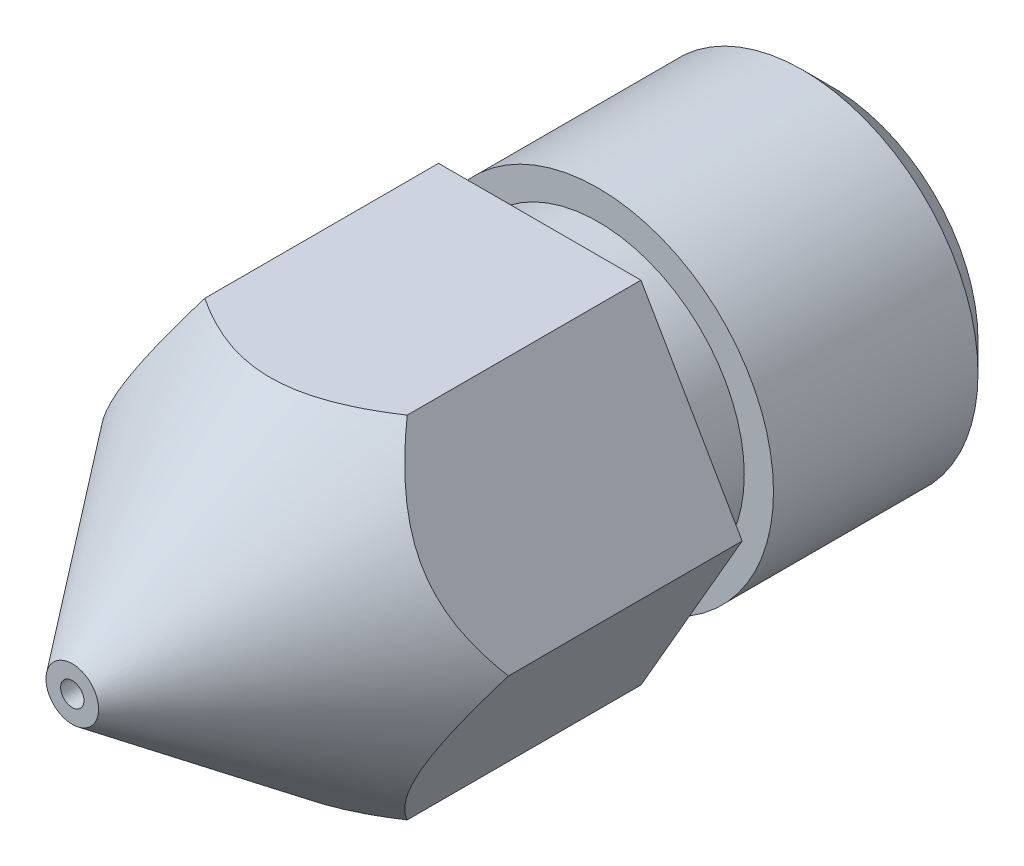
ISO-10303-21;
HEADER;
FILE_DESCRIPTION(('STEP AP214'),'2;1');
FILE_NAME('part.step','',(''),(''),'','','');
FILE_SCHEMA(('AUTOMOTIVE_DESIGN { 1 0 10303 214 1 1 1 1 }'));
ENDSEC;
DATA;
#1=APPLICATION_CONTEXT('core data for automotive mechanical design processes');
#2=APPLICATION_PROTOCOL_DEFINITION('international standard','automotive_design',2000,#1);
#3=PRODUCT_CONTEXT('',#1,'mechanical');
#4=PRODUCT('Part','Part','',(#3));
#5=PRODUCT_RELATED_PRODUCT_CATEGORY('part','',(#4));
#6=PRODUCT_DEFINITION_FORMATION('','',#4);
#7=PRODUCT_DEFINITION_CONTEXT('part definition',#1,'design');
#8=PRODUCT_DEFINITION('design','',#6,#7);
#9=PRODUCT_DEFINITION_SHAPE('','',#8);
#10=(LENGTH_UNIT() NAMED_UNIT(*) SI_UNIT(.MILLI.,.METRE.));
#11=(NAMED_UNIT(*) PLANE_ANGLE_UNIT() SI_UNIT($,.RADIAN.));
#12=(NAMED_UNIT(*) SI_UNIT($,.STERADIAN.) SOLID_ANGLE_UNIT());
#13=UNCERTAINTY_MEASURE_WITH_UNIT(LENGTH_MEASURE(1.E-05),#10,'distance_accuracy_value','');
#14=(GEOMETRIC_REPRESENTATION_CONTEXT(3) GLOBAL_UNCERTAINTY_ASSIGNED_CONTEXT((#13)) GLOBAL_UNIT_ASSIGNED_CONTEXT((#10,
#11,#12)) REPRESENTATION_CONTEXT('',''));
#15=CARTESIAN_POINT('',(0.,0.,0.));
#16=DIRECTION('',(0.,0.,1.));
#17=DIRECTION('',(1.,0.,0.));
#18=AXIS2_PLACEMENT_3D('',#15,#16,#17);
#19=CARTESIAN_POINT('',(0.,0.,0.));
#20=DIRECTION('',(0.,0.,1.));
#21=DIRECTION('',(1.,0.,0.));
#22=AXIS2_PLACEMENT_3D('',#19,#20,#21);
#23=CYLINDRICAL_SURFACE('',#22,2.5);
#24=CARTESIAN_POINT('',(0.,0.,0.));
#25=DIRECTION('',(0.,0.,1.));
#26=DIRECTION('',(1.,0.,0.));
#27=AXIS2_PLACEMENT_3D('',#24,#25,#26);
#28=CIRCLE('',#27,2.5);
#29=CARTESIAN_POINT('',(2.49999999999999,0.,0.));
#30=VERTEX_POINT('',#29);
#31=EDGE_CURVE('E22',#30,#30,#28,.F.);
#32=ORIENTED_EDGE('',*,*,#31,.T.);
#33=EDGE_LOOP('',(#32));
#34=FACE_BOUND('',#33,.T.);
#35=CARTESIAN_POINT('',(0.,0.,-1.));
#36=DIRECTION('',(0.,0.,1.));
#37=DIRECTION('',(1.,0.,0.));
#38=AXIS2_PLACEMENT_3D('',#35,#36,#37);
#39=CIRCLE('',#38,2.5);
#40=CARTESIAN_POINT('',(2.49999999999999,0.,-1.));
#41=VERTEX_POINT('',#40);
#42=EDGE_CURVE('E107',#41,#41,#39,.T.);
#43=ORIENTED_EDGE('',*,*,#42,.T.);
#44=EDGE_LOOP('',(#43));
#45=FACE_BOUND('',#44,.T.);
#46=ADVANCED_FACE('F19',(#34,#45),#23,.T.);
#47=CARTESIAN_POINT('',(0.,0.,0.));
#48=DIRECTION('',(0.,0.,1.));
#49=DIRECTION('',(1.,0.,0.));
#50=AXIS2_PLACEMENT_3D('',#47,#48,#49);
#51=PLANE('',#50);
#52=ORIENTED_EDGE('',*,*,#31,.F.);
#53=EDGE_LOOP('',(#52));
#54=FACE_BOUND('',#53,.T.);
#55=DIRECTION('',(-1.,0.,0.));
#56=VECTOR('',#55,1.);
#57=CARTESIAN_POINT('',(1.73205080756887,3.00000000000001,0.));
#58=LINE('',#57,#56);
#59=CARTESIAN_POINT('',(1.73205080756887,3.00000000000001,0.));
#60=VERTEX_POINT('',#59);
#61=CARTESIAN_POINT('',(-1.73205080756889,2.99999999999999,0.));
#62=VERTEX_POINT('',#61);
#63=EDGE_CURVE('E70',#60,#62,#58,.T.);
#64=ORIENTED_EDGE('',*,*,#63,.F.);
#65=DIRECTION('',(-0.500000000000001,0.866025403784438,0.));
#66=VECTOR('',#65,1.);
#67=CARTESIAN_POINT('',(3.46410161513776,0.,0.));
#68=LINE('',#67,#66);
#69=CARTESIAN_POINT('',(3.46410161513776,0.,0.));
#70=VERTEX_POINT('',#69);
#71=EDGE_CURVE('E100',#70,#60,#68,.T.);
#72=ORIENTED_EDGE('',*,*,#71,.F.);
#73=DIRECTION('',(0.499999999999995,0.866025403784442,0.));
#74=VECTOR('',#73,1.);
#75=CARTESIAN_POINT('',(1.73205080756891,-2.99999999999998,0.));
#76=LINE('',#75,#74);
#77=CARTESIAN_POINT('',(1.73205080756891,-2.99999999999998,0.));
#78=VERTEX_POINT('',#77);
#79=EDGE_CURVE('E105',#78,#70,#76,.T.);
#80=ORIENTED_EDGE('',*,*,#79,.F.);
#81=DIRECTION('',(1.,0.,0.));
#82=VECTOR('',#81,1.);
#83=CARTESIAN_POINT('',(-1.73205080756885,-3.00000000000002,0.));
#84=LINE('',#83,#82);
#85=CARTESIAN_POINT('',(-1.73205080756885,-3.00000000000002,0.));
#86=VERTEX_POINT('',#85);
#87=EDGE_CURVE('E111',#86,#78,#84,.T.);
#88=ORIENTED_EDGE('',*,*,#87,.F.);
#89=DIRECTION('',(0.500000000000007,-0.866025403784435,0.));
#90=VECTOR('',#89,1.);
#91=CARTESIAN_POINT('',(-3.46410161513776,0.,0.));
#92=LINE('',#91,#90);
#93=CARTESIAN_POINT('',(-3.46410161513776,0.,0.));
#94=VERTEX_POINT('',#93);
#95=EDGE_CURVE('E88',#94,#86,#92,.T.);
#96=ORIENTED_EDGE('',*,*,#95,.F.);
#97=DIRECTION('',(-0.499999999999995,-0.866025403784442,0.));
#98=VECTOR('',#97,1.);
#99=CARTESIAN_POINT('',(-1.73205080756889,2.99999999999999,0.));
#100=LINE('',#99,#98);
#101=EDGE_CURVE('E82',#62,#94,#100,.T.);
#102=ORIENTED_EDGE('',*,*,#101,.F.);
#103=EDGE_LOOP('',(#64,#72,#80,#88,#96,#102));
#104=FACE_BOUND('',#103,.T.);
#105=ADVANCED_FACE('F86',(#54,#104),#51,.F.);
#106=CARTESIAN_POINT('',(-3.46410161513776,0.,8.));
#107=DIRECTION('',(-0.866025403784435,-0.500000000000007,0.));
#108=DIRECTION('',(0.500000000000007,-0.866025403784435,0.));
#109=AXIS2_PLACEMENT_3D('',#106,#107,#108);
#110=PLANE('',#109);
#111=ORIENTED_EDGE('',*,*,#95,.T.);
#112=DIRECTION('',(0.,0.,1.));
#113=VECTOR('',#112,1.);
#114=CARTESIAN_POINT('',(-1.73205080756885,-3.00000000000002,8.));
#115=LINE('',#114,#113);
#116=CARTESIAN_POINT('',(-1.73205082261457,-2.99999997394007,4.00000001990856));
#117=VERTEX_POINT('',#116);
#118=EDGE_CURVE('E113',#117,#86,#115,.F.);
#119=ORIENTED_EDGE('',*,*,#118,.F.);
#120=CARTESIAN_POINT('',(-3.46410161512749,-1.78090844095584E-11,3.99999999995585));
#121=CARTESIAN_POINT('',(-3.44069021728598,-0.0405497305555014,4.0310628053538));
#122=CARTESIAN_POINT('',(-3.41706085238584,-0.0814769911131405,4.06148013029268));
#123=CARTESIAN_POINT('',(-3.36934820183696,-0.16411772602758,4.12079172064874));
#124=CARTESIAN_POINT('',(-3.34526518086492,-0.205830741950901,4.14968683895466));
#125=CARTESIAN_POINT('',(-3.29644056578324,-0.290397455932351,4.20594219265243));
#126=CARTESIAN_POINT('',(-3.27169567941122,-0.333256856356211,4.23329106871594));
#127=CARTESIAN_POINT('',(-3.22165527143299,-0.419929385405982,4.28600265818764));
#128=CARTESIAN_POINT('',(-3.19635926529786,-0.463743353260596,4.31136352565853));
#129=CARTESIAN_POINT('',(-3.11910484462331,-0.597551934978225,4.3845024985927));
#130=CARTESIAN_POINT('',(-3.06628459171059,-0.689039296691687,4.42874210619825));
#131=CARTESIAN_POINT('',(-2.95848675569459,-0.875750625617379,4.50488649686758));
#132=CARTESIAN_POINT('',(-2.9035124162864,-0.970968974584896,4.53680909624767));
#133=CARTESIAN_POINT('',(-2.81448457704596,-1.1251697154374,4.57560860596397));
#134=CARTESIAN_POINT('',(-2.78095977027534,-1.18323638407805,4.58739343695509));
#135=CARTESIAN_POINT('',(-2.71351247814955,-1.30005852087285,4.60510403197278));
#136=CARTESIAN_POINT('',(-2.67958993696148,-1.35881408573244,4.61102896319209));
#137=CARTESIAN_POINT('',(-2.61188290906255,-1.47608609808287,4.61672020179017));
#138=CARTESIAN_POINT('',(-2.57809943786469,-1.5346007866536,4.61653462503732));
#139=CARTESIAN_POINT('',(-2.51067843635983,-1.6513773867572,4.61013433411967));
#140=CARTESIAN_POINT('',(-2.47704090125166,-1.70963930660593,4.6039198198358));
#141=CARTESIAN_POINT('',(-2.41030893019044,-1.82522247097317,4.58577671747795));
#142=CARTESIAN_POINT('',(-2.37721275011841,-1.88254673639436,4.57387352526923));
#143=CARTESIAN_POINT('',(-2.31159334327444,-1.99620288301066,4.54483585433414));
#144=CARTESIAN_POINT('',(-2.27907037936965,-2.05253430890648,4.52769903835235));
#145=CARTESIAN_POINT('',(-2.18215411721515,-2.22039819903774,4.46905909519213));
#146=CARTESIAN_POINT('',(-2.11882576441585,-2.33008612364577,4.42045072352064));
#147=CARTESIAN_POINT('',(-1.99999917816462,-2.53589980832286,4.313482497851));
#148=CARTESIAN_POINT('',(-1.94426869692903,-2.63242783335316,4.25611473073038));
#149=CARTESIAN_POINT('',(-1.86291673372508,-2.77333356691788,4.16391653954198));
#150=CARTESIAN_POINT('',(-1.83634125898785,-2.81936363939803,4.13238684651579));
#151=CARTESIAN_POINT('',(-1.78377384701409,-2.91041306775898,4.06749851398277));
#152=CARTESIAN_POINT('',(-1.75778159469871,-2.95543296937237,4.03414089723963));
#153=CARTESIAN_POINT('',(-1.73205083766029,-2.99999994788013,4.0000000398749));
#154=B_SPLINE_CURVE_WITH_KNOTS('',3,(#120,#121,#122,#123,#124,#125,#126,#127,#128,#129,#130,
#131,#132,#133,#134,#135,#136,#137,#138,#139,#140,#141,#142,#143,#144,#145,#146,#147,#148,#149,
#150,#151,#152,#153),.UNSPECIFIED.,.F.,.F.,(4,2,2,2,2,2,2,2,2,2,2,2,2,2,2,2,4),(0.,
0.168572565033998,0.337049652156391,0.506636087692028,0.676378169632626,1.01936499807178,
1.36185382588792,1.56586036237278,1.7698958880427,1.9723251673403,2.17474773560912,
2.37627495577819,2.57789230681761,2.98360296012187,3.3591882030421,3.54455388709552,
3.72981689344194),.UNSPECIFIED.);
#155=CARTESIAN_POINT('',(-3.46410161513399,0.,3.99999999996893));
#156=VERTEX_POINT('',#155);
#157=EDGE_CURVE('E90',#156,#117,#154,.T.);
#158=ORIENTED_EDGE('',*,*,#157,.F.);
#159=DIRECTION('',(0.,0.,1.));
#160=VECTOR('',#159,1.);
#161=CARTESIAN_POINT('',(-3.46410161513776,0.,8.));
#162=LINE('',#161,#160);
#163=EDGE_CURVE('E36',#94,#156,#162,.T.);
#164=ORIENTED_EDGE('',*,*,#163,.F.);
#165=EDGE_LOOP('',(#111,#119,#158,#164));
#166=FACE_BOUND('',#165,.T.);
#167=ADVANCED_FACE('F191',(#166),#110,.T.);
#168=CARTESIAN_POINT('',(-1.73205080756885,-3.00000000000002,8.));
#169=DIRECTION('',(0.,-1.,0.));
#170=DIRECTION('',(1.,0.,0.));
#171=AXIS2_PLACEMENT_3D('',#168,#169,#170);
#172=PLANE('',#171);
#173=ORIENTED_EDGE('',*,*,#87,.T.);
#174=DIRECTION('',(0.,0.,1.));
#175=VECTOR('',#174,1.);
#176=CARTESIAN_POINT('',(1.73205080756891,-2.99999999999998,8.));
#177=LINE('',#176,#175);
#178=CARTESIAN_POINT('',(1.73205077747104,-2.99999999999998,4.00000001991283));
#179=VERTEX_POINT('',#178);
#180=EDGE_CURVE('E108',#179,#78,#177,.F.);
#181=ORIENTED_EDGE('',*,*,#180,.F.);
#182=CARTESIAN_POINT('',(-1.73205080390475,-2.99999997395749,3.99999998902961));
#183=CARTESIAN_POINT('',(-1.68522801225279,-2.9999999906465,4.03106280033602));
#184=CARTESIAN_POINT('',(-1.63796928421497,-2.99999999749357,4.06148012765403));
#185=CARTESIAN_POINT('',(-1.54254398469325,-3.00000000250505,4.12079171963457));
#186=CARTESIAN_POINT('',(-1.4943779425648,-3.00000000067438,4.1496868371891));
#187=CARTESIAN_POINT('',(-1.39672871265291,-2.99999999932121,4.2059421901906));
#188=CARTESIAN_POINT('',(-1.34723894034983,-2.99999999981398,4.23329106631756));
#189=CARTESIAN_POINT('',(-1.24715812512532,-3.00000000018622,4.28600265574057));
#190=CARTESIAN_POINT('',(-1.19656611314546,-3.00000000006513,4.31136352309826));
#191=CARTESIAN_POINT('',(-1.04205727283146,-2.99999999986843,4.38450249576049));
#192=CARTESIAN_POINT('',(-0.936416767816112,-2.99999999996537,4.42874210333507));
#193=CARTESIAN_POINT('',(-0.720821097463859,-3.00000000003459,4.50488649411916));
#194=CARTESIAN_POINT('',(-0.610872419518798,-3.00000000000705,4.53680909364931));
#195=CARTESIAN_POINT('',(-0.432816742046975,-2.99999999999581,4.57560860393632));
#196=CARTESIAN_POINT('',(-0.365767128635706,-2.99999999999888,4.58739343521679));
#197=CARTESIAN_POINT('',(-0.230872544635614,-3.00000000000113,4.60510403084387));
#198=CARTESIAN_POINT('',(-0.16302746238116,-3.0000000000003,4.61102896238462));
#199=CARTESIAN_POINT('',(-0.0276134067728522,-2.9999999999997,4.61672020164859));
#200=CARTESIAN_POINT('',(0.0399535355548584,-2.99999999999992,4.61653462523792));
#201=CARTESIAN_POINT('',(0.174795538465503,-3.00000000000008,4.61013433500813));
#202=CARTESIAN_POINT('',(0.242070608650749,-3.00000000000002,4.60391982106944));
#203=CARTESIAN_POINT('',(0.375534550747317,-2.99999999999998,4.58577671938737));
#204=CARTESIAN_POINT('',(0.441726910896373,-2.99999999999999,4.57387352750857));
#205=CARTESIAN_POINT('',(0.572965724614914,-3.,4.54483585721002));
#206=CARTESIAN_POINT('',(0.638011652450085,-3.,4.52769904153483));
#207=CARTESIAN_POINT('',(0.831844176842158,-2.99999999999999,4.4690590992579));
#208=CARTESIAN_POINT('',(0.958500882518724,-2.99999999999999,4.42045072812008));
#209=CARTESIAN_POINT('',(1.19615405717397,-2.99999999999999,4.31348250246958));
#210=CARTESIAN_POINT('',(1.30761502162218,-2.99999999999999,4.25611473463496));
#211=CARTESIAN_POINT('',(1.47031895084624,-2.99999999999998,4.16391654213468));
#212=CARTESIAN_POINT('',(1.52346990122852,-2.99999999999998,4.13238684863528));
#213=CARTESIAN_POINT('',(1.62860472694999,-2.99999999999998,4.06749851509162));
#214=CARTESIAN_POINT('',(1.68058923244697,-2.99999999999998,4.03414089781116));
#215=CARTESIAN_POINT('',(1.73205074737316,-2.99999999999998,4.00000003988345));
#216=B_SPLINE_CURVE_WITH_KNOTS('',3,(#182,#183,#184,#185,#186,#187,#188,#189,#190,#191,#192,
#193,#194,#195,#196,#197,#198,#199,#200,#201,#202,#203,#204,#205,#206,#207,#208,#209,#210,#211,
#212,#213,#214,#215),.UNSPECIFIED.,.F.,.F.,(4,2,2,2,2,2,2,2,2,2,2,2,2,2,2,2,4),(0.,
0.168572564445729,0.337049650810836,0.50663608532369,0.676378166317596,1.01936499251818,
1.36185381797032,1.56586035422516,1.76989587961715,1.97232515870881,2.17474772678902,
2.37627494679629,2.57789229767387,2.98360295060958,3.35918819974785,3.54455388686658,
3.72981689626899),.UNSPECIFIED.);
#217=EDGE_CURVE('E176',#117,#179,#216,.T.);
#218=ORIENTED_EDGE('',*,*,#217,.F.);
#219=ORIENTED_EDGE('',*,*,#118,.T.);
#220=EDGE_LOOP('',(#173,#181,#218,#219));
#221=FACE_BOUND('',#220,.T.);
#222=ADVANCED_FACE('F186',(#221),#172,.T.);
#223=CARTESIAN_POINT('',(1.73205080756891,-2.99999999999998,8.));
#224=DIRECTION('',(0.866025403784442,-0.499999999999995,0.));
#225=DIRECTION('',(0.499999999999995,0.866025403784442,0.));
#226=AXIS2_PLACEMENT_3D('',#223,#224,#225);
#227=PLANE('',#226);
#228=ORIENTED_EDGE('',*,*,#79,.T.);
#229=DIRECTION('',(0.,0.,1.));
#230=VECTOR('',#229,1.);
#231=CARTESIAN_POINT('',(3.46410161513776,0.,8.));
#232=LINE('',#231,#230);
#233=CARTESIAN_POINT('',(3.46410161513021,0.,3.99999999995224));
#234=VERTEX_POINT('',#233);
#235=EDGE_CURVE('E102',#234,#70,#232,.F.);
#236=ORIENTED_EDGE('',*,*,#235,.F.);
#237=CARTESIAN_POINT('',(1.73205078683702,-2.9999999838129,3.99999998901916));
#238=CARTESIAN_POINT('',(1.75546219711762,-2.95945026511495,4.03106280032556));
#239=CARTESIAN_POINT('',(1.77909156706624,-2.91852300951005,4.0614801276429));
#240=CARTESIAN_POINT('',(1.82680422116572,-2.83588227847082,4.12079171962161));
#241=CARTESIAN_POINT('',(1.85088724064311,-2.79416926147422,4.14968683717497));
#242=CARTESIAN_POINT('',(1.89971185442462,-2.70960254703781,4.2059421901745));
#243=CARTESIAN_POINT('',(1.92445674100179,-2.66674314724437,4.23329106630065));
#244=CARTESIAN_POINT('',(1.97449714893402,-2.58007061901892,4.28600265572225));
#245=CARTESIAN_POINT('',(1.99979315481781,-2.5362566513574,4.31136352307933));
#246=CARTESIAN_POINT('',(2.07704757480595,-2.40244807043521,4.38450249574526));
#247=CARTESIAN_POINT('',(2.12986782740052,-2.31096070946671,4.42874210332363));
#248=CARTESIAN_POINT('',(2.23766566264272,-2.12424938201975,4.50488649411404));
#249=CARTESIAN_POINT('',(2.2926400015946,-2.0290310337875,4.53680909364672));
#250=CARTESIAN_POINT('',(2.38166784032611,-1.87483029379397,4.57560860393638));
#251=CARTESIAN_POINT('',(2.41519264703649,-1.81676362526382,4.58739343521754));
#252=CARTESIAN_POINT('',(2.48263993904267,-1.69994148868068,4.60510403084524));
#253=CARTESIAN_POINT('',(2.51656248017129,-1.64118592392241,4.61102896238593));
#254=CARTESIAN_POINT('',(2.58426950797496,-1.52391391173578,4.61672020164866));
#255=CARTESIAN_POINT('',(2.61805297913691,-1.46539922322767,4.61653462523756));
#256=CARTESIAN_POINT('',(2.68547398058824,-1.34862262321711,4.61013433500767));
#257=CARTESIAN_POINT('',(2.71911151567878,-1.2903607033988,4.60391982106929));
#258=CARTESIAN_POINT('',(2.78584348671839,-1.17477753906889,4.58577671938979));
#259=CARTESIAN_POINT('',(2.81893966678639,-1.11745327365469,4.57387352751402));
#260=CARTESIAN_POINT('',(2.88455907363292,-1.00379712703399,4.54483585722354));
#261=CARTESIAN_POINT('',(2.9170820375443,-0.947465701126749,4.52769904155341));
#262=CARTESIAN_POINT('',(3.01399829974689,-0.779601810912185,4.46905909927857));
#263=CARTESIAN_POINT('',(3.07732665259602,-0.669913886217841,4.42045072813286));
#264=CARTESIAN_POINT('',(3.19615324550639,-0.464100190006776,4.31348249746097));
#265=CARTESIAN_POINT('',(3.25188373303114,-0.367572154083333,4.25611472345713));
#266=CARTESIAN_POINT('',(3.33323570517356,-0.226666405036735,4.16391652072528));
#267=CARTESIAN_POINT('',(3.35981118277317,-0.180636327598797,4.13238682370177));
#268=CARTESIAN_POINT('',(3.41237860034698,-0.0895868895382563,4.06749848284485));
#269=CARTESIAN_POINT('',(3.43837085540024,-0.0445669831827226,4.03414086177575));
#270=CARTESIAN_POINT('',(3.46410161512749,-1.77906543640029E-11,3.99999999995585));
#271=B_SPLINE_CURVE_WITH_KNOTS('',3,(#237,#238,#239,#240,#241,#242,#243,#244,#245,#246,#247,
#248,#249,#250,#251,#252,#253,#254,#255,#256,#257,#258,#259,#260,#261,#262,#263,#264,#265,#266,
#267,#268,#269,#270),.UNSPECIFIED.,.F.,.F.,(4,2,2,2,2,2,2,2,2,2,2,2,2,2,2,2,4),(0.,
0.168572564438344,0.337049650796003,0.50663608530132,0.676378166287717,1.01936499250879,
1.36185381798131,1.56586035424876,1.76989587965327,1.97232515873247,2.17474772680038,
2.37627494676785,2.57789229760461,2.98360295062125,3.35918823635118,3.54455394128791,
3.72981696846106),.UNSPECIFIED.);
#272=EDGE_CURVE('E170',#179,#234,#271,.T.);
#273=ORIENTED_EDGE('',*,*,#272,.F.);
#274=ORIENTED_EDGE('',*,*,#180,.T.);
#275=EDGE_LOOP('',(#228,#236,#273,#274));
#276=FACE_BOUND('',#275,.T.);
#277=ADVANCED_FACE('F183',(#276),#227,.T.);
#278=CARTESIAN_POINT('',(2.99999999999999,0.,-1.));
#279=DIRECTION('',(0.,0.,-1.));
#280=DIRECTION('',(-1.,0.,0.));
#281=AXIS2_PLACEMENT_3D('',#278,#279,#280);
#282=PLANE('',#281);
#283=CARTESIAN_POINT('',(0.,0.,-1.));
#284=DIRECTION('',(0.,0.,1.));
#285=DIRECTION('',(1.,0.,0.));
#286=AXIS2_PLACEMENT_3D('',#283,#284,#285);
#287=CIRCLE('',#286,2.99999999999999);
#288=CARTESIAN_POINT('',(2.99999999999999,0.,-1.));
#289=VERTEX_POINT('',#288);
#290=EDGE_CURVE('E167',#289,#289,#287,.F.);
#291=ORIENTED_EDGE('',*,*,#290,.F.);
#292=EDGE_LOOP('',(#291));
#293=FACE_BOUND('',#292,.T.);
#294=ORIENTED_EDGE('',*,*,#42,.F.);
#295=EDGE_LOOP('',(#294));
#296=FACE_BOUND('',#295,.T.);
#297=ADVANCED_FACE('F158',(#293,#296),#282,.F.);
#298=CARTESIAN_POINT('',(3.46410161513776,0.,8.));
#299=DIRECTION('',(0.866025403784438,0.500000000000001,0.));
#300=DIRECTION('',(-0.500000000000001,0.866025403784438,0.));
#301=AXIS2_PLACEMENT_3D('',#298,#299,#300);
#302=PLANE('',#301);
#303=ORIENTED_EDGE('',*,*,#71,.T.);
#304=DIRECTION('',(0.,0.,1.));
#305=VECTOR('',#304,1.);
#306=CARTESIAN_POINT('',(1.73205080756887,3.00000000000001,8.));
#307=LINE('',#306,#305);
#308=CARTESIAN_POINT('',(1.73205082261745,2.9999999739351,4.00000001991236));
#309=VERTEX_POINT('',#308);
#310=EDGE_CURVE('E76',#309,#60,#307,.F.);
#311=ORIENTED_EDGE('',*,*,#310,.F.);
#312=CARTESIAN_POINT('',(3.46410161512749,1.77913089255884E-11,3.99999999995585));
#313=CARTESIAN_POINT('',(3.44069021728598,0.040549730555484,4.03106280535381));
#314=CARTESIAN_POINT('',(3.41706085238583,0.0814769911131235,4.06148013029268));
#315=CARTESIAN_POINT('',(3.36934820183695,0.164117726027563,4.12079172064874));
#316=CARTESIAN_POINT('',(3.34526518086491,0.205830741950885,4.14968683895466));
#317=CARTESIAN_POINT('',(3.29644056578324,0.290397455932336,4.20594219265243));
#318=CARTESIAN_POINT('',(3.27169567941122,0.333256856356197,4.23329106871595));
#319=CARTESIAN_POINT('',(3.22165527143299,0.419929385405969,4.28600265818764));
#320=CARTESIAN_POINT('',(3.19635926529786,0.463743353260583,4.31136352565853));
#321=CARTESIAN_POINT('',(3.1191048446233,0.597551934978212,4.3845024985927));
#322=CARTESIAN_POINT('',(3.06628459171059,0.689039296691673,4.42874210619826));
#323=CARTESIAN_POINT('',(2.95848675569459,0.875750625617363,4.50488649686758));
#324=CARTESIAN_POINT('',(2.9035124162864,0.970968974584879,4.53680909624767));
#325=CARTESIAN_POINT('',(2.81448457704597,1.12516971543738,4.57560860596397));
#326=CARTESIAN_POINT('',(2.78095977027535,1.18323638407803,4.58739343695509));
#327=CARTESIAN_POINT('',(2.71351247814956,1.30005852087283,4.60510403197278));
#328=CARTESIAN_POINT('',(2.67958993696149,1.35881408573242,4.61102896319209));
#329=CARTESIAN_POINT('',(2.61188290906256,1.47608609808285,4.61672020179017));
#330=CARTESIAN_POINT('',(2.5780994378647,1.53460078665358,4.61653462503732));
#331=CARTESIAN_POINT('',(2.51067843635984,1.65137738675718,4.61013433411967));
#332=CARTESIAN_POINT('',(2.47704090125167,1.70963930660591,4.6039198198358));
#333=CARTESIAN_POINT('',(2.41030893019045,1.82522247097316,4.58577671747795));
#334=CARTESIAN_POINT('',(2.37721275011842,1.88254673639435,4.57387352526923));
#335=CARTESIAN_POINT('',(2.31159334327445,1.99620288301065,4.54483585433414));
#336=CARTESIAN_POINT('',(2.27907037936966,2.05253430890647,4.52769903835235));
#337=CARTESIAN_POINT('',(2.18215411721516,2.22039819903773,4.46905909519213));
#338=CARTESIAN_POINT('',(2.11882576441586,2.33008612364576,4.42045072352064));
#339=CARTESIAN_POINT('',(1.9999991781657,2.53589980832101,4.31348249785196));
#340=CARTESIAN_POINT('',(1.94426869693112,2.63242783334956,4.25611473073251));
#341=CARTESIAN_POINT('',(1.8629167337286,2.7733335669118,4.16391653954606));
#342=CARTESIAN_POINT('',(1.83634125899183,2.81936363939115,4.13238684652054));
#343=CARTESIAN_POINT('',(1.78377384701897,2.91041306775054,4.06749851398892));
#344=CARTESIAN_POINT('',(1.75778159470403,2.95543296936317,4.03414089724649));
#345=CARTESIAN_POINT('',(1.73205083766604,2.99999994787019,4.00000003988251));
#346=B_SPLINE_CURVE_WITH_KNOTS('',3,(#312,#313,#314,#315,#316,#317,#318,#319,#320,#321,#322,
#323,#324,#325,#326,#327,#328,#329,#330,#331,#332,#333,#334,#335,#336,#337,#338,#339,#340,#341,
#342,#343,#344,#345),.UNSPECIFIED.,.F.,.F.,(4,2,2,2,2,2,2,2,2,2,2,2,2,2,2,2,4),(0.,
0.168572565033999,0.337049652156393,0.506636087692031,0.67637816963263,1.01936499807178,
1.36185382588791,1.56586036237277,1.76989588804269,1.97232516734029,2.17474773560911,
2.37627495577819,2.57789230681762,2.98360296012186,3.35918820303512,3.54455388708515,
3.72981689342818),.UNSPECIFIED.);
#347=EDGE_CURVE('E161',#234,#309,#346,.T.);
#348=ORIENTED_EDGE('',*,*,#347,.F.);
#349=ORIENTED_EDGE('',*,*,#235,.T.);
#350=EDGE_LOOP('',(#303,#311,#348,#349));
#351=FACE_BOUND('',#350,.T.);
#352=ADVANCED_FACE('F154',(#351),#302,.T.);
#353=CARTESIAN_POINT('',(1.73205080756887,3.00000000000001,8.));
#354=DIRECTION('',(0.,1.,0.));
#355=DIRECTION('',(-1.,0.,0.));
#356=AXIS2_PLACEMENT_3D('',#353,#354,#355);
#357=PLANE('',#356);
#358=ORIENTED_EDGE('',*,*,#63,.T.);
#359=DIRECTION('',(0.,0.,1.));
#360=VECTOR('',#359,1.);
#361=CARTESIAN_POINT('',(-1.73205080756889,2.99999999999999,8.));
#362=LINE('',#361,#360);
#363=CARTESIAN_POINT('',(-1.73205077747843,2.99999999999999,4.00000001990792));
#364=VERTEX_POINT('',#363);
#365=EDGE_CURVE('E74',#364,#62,#362,.F.);
#366=ORIENTED_EDGE('',*,*,#365,.F.);
#367=CARTESIAN_POINT('',(1.73205080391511,2.99999997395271,3.99999998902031));
#368=CARTESIAN_POINT('',(1.68522801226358,2.99999999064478,4.03106280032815));
#369=CARTESIAN_POINT('',(1.63796928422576,2.9999999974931,4.06148012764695));
#370=CARTESIAN_POINT('',(1.54254398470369,3.0000000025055,4.12079171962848));
#371=CARTESIAN_POINT('',(1.49437794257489,3.0000000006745,4.14968683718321));
#372=CARTESIAN_POINT('',(1.39672871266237,2.99999999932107,4.20594219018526));
#373=CARTESIAN_POINT('',(1.34723894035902,2.99999999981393,4.23329106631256));
#374=CARTESIAN_POINT('',(1.24715812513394,3.00000000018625,4.28600265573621));
#375=CARTESIAN_POINT('',(1.19656611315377,3.00000000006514,4.31136352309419));
#376=CARTESIAN_POINT('',(1.04205727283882,2.9999999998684,4.38450249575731));
#377=CARTESIAN_POINT('',(0.936416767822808,2.99999999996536,4.42874210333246));
#378=CARTESIAN_POINT('',(0.720821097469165,3.0000000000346,4.50488649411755));
#379=CARTESIAN_POINT('',(0.610872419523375,3.00000000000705,4.53680909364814));
#380=CARTESIAN_POINT('',(0.432816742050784,2.9999999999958,4.5756086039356));
#381=CARTESIAN_POINT('',(0.365767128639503,2.99999999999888,4.58739343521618));
#382=CARTESIAN_POINT('',(0.230872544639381,3.00000000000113,4.60510403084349));
#383=CARTESIAN_POINT('',(0.163027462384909,3.0000000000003,4.61102896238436));
#384=CARTESIAN_POINT('',(0.0276134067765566,2.9999999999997,4.61672020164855));
#385=CARTESIAN_POINT('',(-0.0399535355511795,2.99999999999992,4.61653462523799));
#386=CARTESIAN_POINT('',(-0.174795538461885,3.00000000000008,4.61013433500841));
#387=CARTESIAN_POINT('',(-0.242070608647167,3.00000000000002,4.60391982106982));
#388=CARTESIAN_POINT('',(-0.375534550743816,2.99999999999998,4.58577671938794));
#389=CARTESIAN_POINT('',(-0.441726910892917,2.99999999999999,4.57387352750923));
#390=CARTESIAN_POINT('',(-0.572965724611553,3.,4.54483585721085));
#391=CARTESIAN_POINT('',(-0.638011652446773,3.,4.52769904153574));
#392=CARTESIAN_POINT('',(-0.831844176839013,2.99999999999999,4.46905909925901));
#393=CARTESIAN_POINT('',(-0.958500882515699,3.,4.4204507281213));
#394=CARTESIAN_POINT('',(-1.19615405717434,3.,4.31348250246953));
#395=CARTESIAN_POINT('',(-1.30761502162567,3.,4.2561147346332));
#396=CARTESIAN_POINT('',(-1.47031895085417,3.,4.16391654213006));
#397=CARTESIAN_POINT('',(-1.52346990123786,3.,4.13238684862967));
#398=CARTESIAN_POINT('',(-1.62860472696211,2.99999999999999,4.06749851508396));
#399=CARTESIAN_POINT('',(-1.68058923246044,2.99999999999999,4.03414089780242));
#400=CARTESIAN_POINT('',(-1.73205074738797,2.99999999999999,4.00000003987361));
#401=B_SPLINE_CURVE_WITH_KNOTS('',3,(#367,#368,#369,#370,#371,#372,#373,#374,#375,#376,#377,
#378,#379,#380,#381,#382,#383,#384,#385,#386,#387,#388,#389,#390,#391,#392,#393,#394,#395,#396,
#397,#398,#399,#400),.UNSPECIFIED.,.F.,.F.,(4,2,2,2,2,2,2,2,2,2,2,2,2,2,2,2,4),(0.,
0.168572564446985,0.337049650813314,0.506636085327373,0.6763781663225,1.01936499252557,
1.36185381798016,1.56586035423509,1.76989587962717,1.9723251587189,2.17474772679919,
2.37627494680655,2.5778922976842,2.98360295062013,3.35918819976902,3.54455388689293,
3.72981689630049),.UNSPECIFIED.);
#402=EDGE_CURVE('E137',#309,#364,#401,.T.);
#403=ORIENTED_EDGE('',*,*,#402,.F.);
#404=ORIENTED_EDGE('',*,*,#310,.T.);
#405=EDGE_LOOP('',(#358,#366,#403,#404));
#406=FACE_BOUND('',#405,.T.);
#407=ADVANCED_FACE('F72',(#406),#357,.T.);
#408=CARTESIAN_POINT('',(-1.73205080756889,2.99999999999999,8.));
#409=DIRECTION('',(-0.866025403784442,0.499999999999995,0.));
#410=DIRECTION('',(-0.499999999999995,-0.866025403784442,0.));
#411=AXIS2_PLACEMENT_3D('',#408,#409,#410);
#412=PLANE('',#411);
#413=ORIENTED_EDGE('',*,*,#101,.T.);
#414=ORIENTED_EDGE('',*,*,#163,.T.);
#415=CARTESIAN_POINT('',(-1.73205078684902,2.99999998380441,3.99999998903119));
#416=CARTESIAN_POINT('',(-1.75546219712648,2.95945026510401,4.03106280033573));
#417=CARTESIAN_POINT('',(-1.7790915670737,2.9185230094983,4.06148012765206));
#418=CARTESIAN_POINT('',(-1.82680422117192,2.83588227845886,4.12079171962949));
#419=CARTESIAN_POINT('',(-1.85088724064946,2.79416926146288,4.14968683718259));
#420=CARTESIAN_POINT('',(-1.89971185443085,2.70960254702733,4.20594219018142));
#421=CARTESIAN_POINT('',(-1.92445674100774,2.66674314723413,4.23329106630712));
#422=CARTESIAN_POINT('',(-1.97449714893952,2.58007061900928,4.28600265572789));
#423=CARTESIAN_POINT('',(-1.99979315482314,2.53625665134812,4.31136352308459));
#424=CARTESIAN_POINT('',(-2.0770475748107,2.40244807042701,4.38450249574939));
#425=CARTESIAN_POINT('',(-2.12986782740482,2.31096070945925,4.42874210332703));
#426=CARTESIAN_POINT('',(-2.23766566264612,2.12424938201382,4.50488649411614));
#427=CARTESIAN_POINT('',(-2.29264000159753,2.02903103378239,4.53680909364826));
#428=CARTESIAN_POINT('',(-2.38166784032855,1.87483029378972,4.57560860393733));
#429=CARTESIAN_POINT('',(-2.41519264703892,1.81676362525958,4.58739343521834));
#430=CARTESIAN_POINT('',(-2.48263993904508,1.69994148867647,4.60510403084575));
#431=CARTESIAN_POINT('',(-2.51656248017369,1.64118592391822,4.61102896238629));
#432=CARTESIAN_POINT('',(-2.58426950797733,1.52391391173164,4.61672020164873));
#433=CARTESIAN_POINT('',(-2.61805297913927,1.46539922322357,4.6165346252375));
#434=CARTESIAN_POINT('',(-2.68547398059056,1.34862262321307,4.61013433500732));
#435=CARTESIAN_POINT('',(-2.71911151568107,1.29036070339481,4.60391982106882));
#436=CARTESIAN_POINT('',(-2.78584348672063,1.17477753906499,4.58577671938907));
#437=CARTESIAN_POINT('',(-2.8189396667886,1.11745327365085,4.57387352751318));
#438=CARTESIAN_POINT('',(-2.88455907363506,1.00379712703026,4.54483585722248));
#439=CARTESIAN_POINT('',(-2.91708203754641,0.947465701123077,4.52769904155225));
#440=CARTESIAN_POINT('',(-3.01399829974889,0.779601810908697,4.46905909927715));
#441=CARTESIAN_POINT('',(-3.07732665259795,0.669913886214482,4.42045072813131));
#442=CARTESIAN_POINT('',(-3.1961532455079,0.464100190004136,4.31348249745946));
#443=CARTESIAN_POINT('',(-3.25188373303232,0.36757215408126,4.25611472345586));
#444=CARTESIAN_POINT('',(-3.33323570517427,0.226666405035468,4.16391652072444));
#445=CARTESIAN_POINT('',(-3.35981118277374,0.180636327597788,4.13238682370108));
#446=CARTESIAN_POINT('',(-3.41237860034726,0.089586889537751,4.06749848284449));
#447=CARTESIAN_POINT('',(-3.43837085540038,0.0445669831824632,4.03414086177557));
#448=CARTESIAN_POINT('',(-3.46410161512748,1.77726889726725E-11,3.99999999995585));
#449=B_SPLINE_CURVE_WITH_KNOTS('',3,(#415,#416,#417,#418,#419,#420,#421,#422,#423,#424,#425,
#426,#427,#428,#429,#430,#431,#432,#433,#434,#435,#436,#437,#438,#439,#440,#441,#442,#443,#444,
#445,#446,#447,#448),.UNSPECIFIED.,.F.,.F.,(4,2,2,2,2,2,2,2,2,2,2,2,2,2,2,2,4),(0.,
0.16857256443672,0.3370496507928,0.50663608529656,0.676378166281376,1.01936499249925,
1.36185381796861,1.56586035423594,1.76989587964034,1.97232515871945,2.17474772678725,
2.37627494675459,2.57789229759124,2.98360295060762,3.35918823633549,3.54455394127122,
3.72981696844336),.UNSPECIFIED.);
#450=EDGE_CURVE('E84',#364,#156,#449,.T.);
#451=ORIENTED_EDGE('',*,*,#450,.F.);
#452=ORIENTED_EDGE('',*,*,#365,.T.);
#453=EDGE_LOOP('',(#413,#414,#451,#452));
#454=FACE_BOUND('',#453,.T.);
#455=ADVANCED_FACE('F81',(#454),#412,.T.);
#456=CARTESIAN_POINT('',(0.,0.,-5.));
#457=DIRECTION('',(0.,0.,1.));
#458=DIRECTION('',(1.,0.,0.));
#459=AXIS2_PLACEMENT_3D('',#456,#457,#458);
#460=CYLINDRICAL_SURFACE('',#459,2.99999999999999);
#461=ORIENTED_EDGE('',*,*,#290,.T.);
#462=EDGE_LOOP('',(#461));
#463=FACE_BOUND('',#462,.T.);
#464=CARTESIAN_POINT('',(0.,0.,-4.50000000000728));
#465=DIRECTION('',(0.,0.,1.));
#466=DIRECTION('',(1.,0.,0.));
#467=AXIS2_PLACEMENT_3D('',#464,#465,#466);
#468=CIRCLE('',#467,2.9999999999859);
#469=CARTESIAN_POINT('',(2.9999999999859,0.,-4.50000000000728));
#470=VERTEX_POINT('',#469);
#471=EDGE_CURVE('E129',#470,#470,#468,.F.);
#472=ORIENTED_EDGE('',*,*,#471,.F.);
#473=EDGE_LOOP('',(#472));
#474=FACE_BOUND('',#473,.T.);
#475=ADVANCED_FACE('F150',(#463,#474),#460,.T.);
#476=CARTESIAN_POINT('',(0.,0.,3.97599999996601));
#477=DIRECTION('',(0.,0.,-1.));
#478=DIRECTION('',(-1.,0.,0.));
#479=AXIS2_PLACEMENT_3D('',#476,#477,#478);
#480=CONICAL_SURFACE('',#479,3.48218691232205,0.645771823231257);
#481=ORIENTED_EDGE('',*,*,#272,.T.);
#482=ORIENTED_EDGE('',*,*,#347,.T.);
#483=ORIENTED_EDGE('',*,*,#402,.T.);
#484=ORIENTED_EDGE('',*,*,#450,.T.);
#485=ORIENTED_EDGE('',*,*,#157,.T.);
#486=ORIENTED_EDGE('',*,*,#217,.T.);
#487=EDGE_LOOP('',(#481,#482,#483,#484,#485,#486));
#488=FACE_BOUND('',#487,.T.);
#489=CARTESIAN_POINT('',(0.,0.,8.0000000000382));
#490=DIRECTION('',(0.,0.,-1.));
#491=DIRECTION('',(-1.,0.,0.));
#492=AXIS2_PLACEMENT_3D('',#489,#490,#491);
#493=CIRCLE('',#492,0.449885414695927);
#494=CARTESIAN_POINT('',(-0.449885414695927,0.,8.0000000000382));
#495=VERTEX_POINT('',#494);
#496=EDGE_CURVE('E126',#495,#495,#493,.F.);
#497=ORIENTED_EDGE('',*,*,#496,.F.);
#498=EDGE_LOOP('',(#497));
#499=FACE_BOUND('',#498,.T.);
#500=ADVANCED_FACE('F144',(#488,#499),#480,.T.);
#501=CARTESIAN_POINT('',(0.,0.,-4.50000000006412));
#502=DIRECTION('',(0.,0.,1.));
#503=DIRECTION('',(1.,0.,0.));
#504=AXIS2_PLACEMENT_3D('',#501,#502,#503);
#505=CONICAL_SURFACE('',#504,2.99999999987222,0.785398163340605);
#506=ORIENTED_EDGE('',*,*,#471,.T.);
#507=EDGE_LOOP('',(#506));
#508=FACE_BOUND('',#507,.T.);
#509=CARTESIAN_POINT('',(0.,0.,-4.99999999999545));
#510=DIRECTION('',(0.,0.,1.));
#511=DIRECTION('',(1.,0.,0.));
#512=AXIS2_PLACEMENT_3D('',#509,#510,#511);
#513=CIRCLE('',#512,2.49999999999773);
#514=CARTESIAN_POINT('',(2.49999999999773,0.,-4.99999999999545));
#515=VERTEX_POINT('',#514);
#516=EDGE_CURVE('E123',#515,#515,#513,.F.);
#517=ORIENTED_EDGE('',*,*,#516,.F.);
#518=EDGE_LOOP('',(#517));
#519=FACE_BOUND('',#518,.T.);
#520=ADVANCED_FACE('F258',(#508,#519),#505,.T.);
#521=CARTESIAN_POINT('',(0.,0.,8.));
#522=DIRECTION('',(0.,0.,1.));
#523=DIRECTION('',(1.,0.,0.));
#524=AXIS2_PLACEMENT_3D('',#521,#522,#523);
#525=PLANE('',#524);
#526=ORIENTED_EDGE('',*,*,#496,.T.);
#527=EDGE_LOOP('',(#526));
#528=FACE_BOUND('',#527,.T.);
#529=CARTESIAN_POINT('',(0.,0.,8.));
#530=DIRECTION('',(0.,0.,1.));
#531=DIRECTION('',(1.,0.,0.));
#532=AXIS2_PLACEMENT_3D('',#529,#530,#531);
#533=CIRCLE('',#532,0.2);
#534=CARTESIAN_POINT('',(0.2,0.,8.));
#535=VERTEX_POINT('',#534);
#536=EDGE_CURVE('E120',#535,#535,#533,.F.);
#537=ORIENTED_EDGE('',*,*,#536,.T.);
#538=EDGE_LOOP('',(#537));
#539=FACE_BOUND('',#538,.T.);
#540=ADVANCED_FACE('F255',(#528,#539),#525,.T.);
#541=CARTESIAN_POINT('',(0.,0.,-5.));
#542=DIRECTION('',(0.,0.,-1.));
#543=DIRECTION('',(-1.,0.,0.));
#544=AXIS2_PLACEMENT_3D('',#541,#542,#543);
#545=PLANE('',#544);
#546=ORIENTED_EDGE('',*,*,#516,.T.);
#547=EDGE_LOOP('',(#546));
#548=FACE_BOUND('',#547,.T.);
#549=CARTESIAN_POINT('',(0.,0.,-4.99999999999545));
#550=DIRECTION('',(0.,0.,-1.));
#551=DIRECTION('',(-1.,0.,0.));
#552=AXIS2_PLACEMENT_3D('',#549,#550,#551);
#553=CIRCLE('',#552,1.50000000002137);
#554=CARTESIAN_POINT('',(-1.50000000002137,0.,-4.99999999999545));
#555=VERTEX_POINT('',#554);
#556=EDGE_CURVE('E116',#555,#555,#553,.F.);
#557=ORIENTED_EDGE('',*,*,#556,.T.);
#558=EDGE_LOOP('',(#557));
#559=FACE_BOUND('',#558,.T.);
#560=ADVANCED_FACE('F251',(#548,#559),#545,.T.);
#561=CARTESIAN_POINT('',(0.,0.,-5.));
#562=DIRECTION('',(0.,0.,1.));
#563=DIRECTION('',(1.,0.,0.));
#564=AXIS2_PLACEMENT_3D('',#561,#562,#563);
#565=CYLINDRICAL_SURFACE('',#564,0.2);
#566=ORIENTED_EDGE('',*,*,#536,.F.);
#567=EDGE_LOOP('',(#566));
#568=FACE_BOUND('',#567,.T.);
#569=CARTESIAN_POINT('',(0.,0.,7.20000000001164));
#570=DIRECTION('',(0.,0.,-1.));
#571=DIRECTION('',(-1.,0.,0.));
#572=AXIS2_PLACEMENT_3D('',#569,#570,#571);
#573=CIRCLE('',#572,0.199999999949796);
#574=CARTESIAN_POINT('',(0.,0.200000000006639,7.20000000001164));
#575=VERTEX_POINT('',#574);
#576=EDGE_CURVE('E119',#575,#575,#573,.T.);
#577=ORIENTED_EDGE('',*,*,#576,.T.);
#578=EDGE_LOOP('',(#577));
#579=FACE_BOUND('',#578,.T.);
#580=ADVANCED_FACE('F247',(#568,#579),#565,.F.);
#581=CARTESIAN_POINT('',(0.,0.,-4.99999999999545));
#582=DIRECTION('',(0.,0.,-1.));
#583=DIRECTION('',(-1.,0.,0.));
#584=AXIS2_PLACEMENT_3D('',#581,#582,#583);
#585=CONICAL_SURFACE('',#584,1.50000000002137,0.785398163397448);
#586=ORIENTED_EDGE('',*,*,#556,.F.);
#587=EDGE_LOOP('',(#586));
#588=FACE_BOUND('',#587,.T.);
#589=CARTESIAN_POINT('',(0.,0.,-4.49999999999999));
#590=DIRECTION('',(0.,0.,-1.));
#591=DIRECTION('',(-1.,0.,0.));
#592=AXIS2_PLACEMENT_3D('',#589,#590,#591);
#593=CIRCLE('',#592,0.999999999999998);
#594=CARTESIAN_POINT('',(-0.999999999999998,0.,-4.49999999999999));
#595=VERTEX_POINT('',#594);
#596=EDGE_CURVE('E28',#595,#595,#593,.F.);
#597=ORIENTED_EDGE('',*,*,#596,.T.);
#598=EDGE_LOOP('',(#597));
#599=FACE_BOUND('',#598,.T.);
#600=ADVANCED_FACE('F239',(#588,#599),#585,.F.);
#601=CARTESIAN_POINT('',(0.,0.,6.40000000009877));
#602=DIRECTION('',(0.,0.,-1.));
#603=DIRECTION('',(0.,1.,0.));
#604=AXIS2_PLACEMENT_3D('',#601,#602,#603);
#605=CONICAL_SURFACE('',#604,0.999999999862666,0.785398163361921);
#606=CARTESIAN_POINT('',(0.,0.,6.4));
#607=DIRECTION('',(0.,0.,-1.));
#608=DIRECTION('',(-1.,0.,0.));
#609=AXIS2_PLACEMENT_3D('',#606,#607,#608);
#610=CIRCLE('',#609,0.999999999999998);
#611=CARTESIAN_POINT('',(0.,0.999999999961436,6.4));
#612=VERTEX_POINT('',#611);
#613=EDGE_CURVE('E11',#612,#612,#610,.T.);
#614=CARTESIAN_POINT('',(0.,0.200000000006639,7.20000000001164));
#615=CARTESIAN_POINT('',(0.,0.208333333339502,7.19166666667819));
#616=CARTESIAN_POINT('',(0.,0.216666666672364,7.18333333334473));
#617=CARTESIAN_POINT('',(0.,0.233333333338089,7.16666666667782));
#618=CARTESIAN_POINT('',(0.,0.241666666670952,7.15833333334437));
#619=CARTESIAN_POINT('',(0.,0.258333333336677,7.14166666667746));
#620=CARTESIAN_POINT('',(0.,0.266666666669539,7.13333333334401));
#621=CARTESIAN_POINT('',(0.,0.283333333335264,7.1166666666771));
#622=CARTESIAN_POINT('',(0.,0.291666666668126,7.10833333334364));
#623=CARTESIAN_POINT('',(0.,0.308333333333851,7.09166666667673));
#624=CARTESIAN_POINT('',(0.,0.316666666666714,7.08333333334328));
#625=CARTESIAN_POINT('',(0.,0.333333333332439,7.06666666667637));
#626=CARTESIAN_POINT('',(0.,0.341666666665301,7.05833333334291));
#627=CARTESIAN_POINT('',(0.,0.358333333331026,7.041666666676));
#628=CARTESIAN_POINT('',(0.,0.366666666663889,7.03333333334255));
#629=CARTESIAN_POINT('',(0.,0.383333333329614,7.01666666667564));
#630=CARTESIAN_POINT('',(0.,0.391666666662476,7.00833333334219));
#631=CARTESIAN_POINT('',(0.,0.408333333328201,6.99166666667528));
#632=CARTESIAN_POINT('',(0.,0.416666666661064,6.98333333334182));
#633=CARTESIAN_POINT('',(0.,0.433333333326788,6.96666666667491));
#634=CARTESIAN_POINT('',(0.,0.441666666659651,6.95833333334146));
#635=CARTESIAN_POINT('',(0.,0.458333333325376,6.94166666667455));
#636=CARTESIAN_POINT('',(0.,0.466666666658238,6.9333333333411));
#637=CARTESIAN_POINT('',(0.,0.483333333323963,6.91666666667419));
#638=CARTESIAN_POINT('',(0.,0.491666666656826,6.90833333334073));
#639=CARTESIAN_POINT('',(0.,0.508333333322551,6.89166666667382));
#640=CARTESIAN_POINT('',(0.,0.516666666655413,6.88333333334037));
#641=CARTESIAN_POINT('',(0.,0.533333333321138,6.86666666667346));
#642=CARTESIAN_POINT('',(0.,0.541666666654,6.85833333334));
#643=CARTESIAN_POINT('',(0.,0.558333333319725,6.84166666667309));
#644=CARTESIAN_POINT('',(0.,0.566666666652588,6.83333333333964));
#645=CARTESIAN_POINT('',(0.,0.583333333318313,6.81666666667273));
#646=CARTESIAN_POINT('',(0.,0.591666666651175,6.80833333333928));
#647=CARTESIAN_POINT('',(0.,0.6083333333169,6.79166666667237));
#648=CARTESIAN_POINT('',(0.,0.616666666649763,6.78333333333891));
#649=CARTESIAN_POINT('',(0.,0.633333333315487,6.766666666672));
#650=CARTESIAN_POINT('',(0.,0.64166666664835,6.75833333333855));
#651=CARTESIAN_POINT('',(0.,0.658333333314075,6.74166666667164));
#652=CARTESIAN_POINT('',(0.,0.666666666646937,6.73333333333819));
#653=CARTESIAN_POINT('',(0.,0.683333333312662,6.71666666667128));
#654=CARTESIAN_POINT('',(0.,0.691666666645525,6.70833333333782));
#655=CARTESIAN_POINT('',(0.,0.708333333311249,6.69166666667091));
#656=CARTESIAN_POINT('',(0.,0.716666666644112,6.68333333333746));
#657=CARTESIAN_POINT('',(0.,0.733333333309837,6.66666666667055));
#658=CARTESIAN_POINT('',(0.,0.741666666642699,6.65833333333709));
#659=CARTESIAN_POINT('',(0.,0.758333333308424,6.64166666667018));
#660=CARTESIAN_POINT('',(0.,0.766666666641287,6.63333333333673));
#661=CARTESIAN_POINT('',(0.,0.783333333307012,6.61666666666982));
#662=CARTESIAN_POINT('',(0.,0.791666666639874,6.60833333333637));
#663=CARTESIAN_POINT('',(0.,0.808333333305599,6.59166666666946));
#664=CARTESIAN_POINT('',(0.,0.816666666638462,6.583333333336));
#665=CARTESIAN_POINT('',(0.,0.833333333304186,6.56666666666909));
#666=CARTESIAN_POINT('',(0.,0.841666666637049,6.55833333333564));
#667=CARTESIAN_POINT('',(0.,0.858333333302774,6.54166666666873));
#668=CARTESIAN_POINT('',(0.,0.866666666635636,6.53333333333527));
#669=CARTESIAN_POINT('',(0.,0.883333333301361,6.51666666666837));
#670=CARTESIAN_POINT('',(0.,0.891666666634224,6.50833333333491));
#671=CARTESIAN_POINT('',(0.,0.908333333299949,6.491666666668));
#672=CARTESIAN_POINT('',(0.,0.916666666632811,6.48333333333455));
#673=CARTESIAN_POINT('',(0.,0.933333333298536,6.46666666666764));
#674=CARTESIAN_POINT('',(0.,0.941666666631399,6.45833333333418));
#675=CARTESIAN_POINT('',(0.,0.958333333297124,6.44166666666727));
#676=CARTESIAN_POINT('',(0.,0.966666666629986,6.43333333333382));
#677=CARTESIAN_POINT('',(0.,0.983333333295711,6.41666666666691));
#678=CARTESIAN_POINT('',(0.,0.991666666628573,6.40833333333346));
#679=CARTESIAN_POINT('',(0.,0.999999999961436,6.4));
#680=B_SPLINE_CURVE_WITH_KNOTS('',3,(#614,#615,#616,#617,#618,#619,#620,#621,#622,#623,#624,
#625,#626,#627,#628,#629,#630,#631,#632,#633,#634,#635,#636,#637,#638,#639,#640,#641,#642,#643,
#644,#645,#646,#647,#648,#649,#650,#651,#652,#653,#654,#655,#656,#657,#658,#659,#660,#661,#662,
#663,#664,#665,#666,#667,#668,#669,#670,#671,#672,#673,#674,#675,#676,#677,#678,#679),
.UNSPECIFIED.,.F.,.F.,(4,2,2,2,2,2,2,2,2,2,2,2,2,2,2,2,2,2,2,2,2,2,2,2,2,2,2,2,2,2,2,2,4),(0.,
0.0353553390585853,0.0707106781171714,0.106066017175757,0.141421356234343,0.176776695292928,
0.212132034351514,0.2474873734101,0.282842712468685,0.318198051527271,0.353553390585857,
0.388908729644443,0.424264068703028,0.459619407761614,0.4949747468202,0.530330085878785,
0.565685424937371,0.601040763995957,0.636396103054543,0.671751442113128,0.707106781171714,
0.7424621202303,0.777817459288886,0.813172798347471,0.848528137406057,0.883883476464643,
0.919238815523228,0.954594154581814,0.9899494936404,1.02530483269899,1.06066017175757,
1.09601551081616,1.13137084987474),.UNSPECIFIED.);
#681=EDGE_CURVE('BSEAM233',#575,#612,#680,.T.);
#682=ORIENTED_EDGE('',*,*,#576,.F.);
#683=ORIENTED_EDGE('',*,*,#613,.T.);
#684=ORIENTED_EDGE('',*,*,#681,.T.);
#685=ORIENTED_EDGE('',*,*,#681,.F.);
#686=EDGE_LOOP('',(#682,#684,#683,#685));
#687=FACE_BOUND('',#686,.T.);
#688=ADVANCED_FACE('F233',(#687),#605,.F.);
#689=CARTESIAN_POINT('',(0.,0.,-5.));
#690=DIRECTION('',(0.,0.,-1.));
#691=DIRECTION('',(-1.,0.,0.));
#692=AXIS2_PLACEMENT_3D('',#689,#690,#691);
#693=CYLINDRICAL_SURFACE('',#692,0.999999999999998);
#694=ORIENTED_EDGE('',*,*,#596,.F.);
#695=EDGE_LOOP('',(#694));
#696=FACE_BOUND('',#695,.T.);
#697=ORIENTED_EDGE('',*,*,#613,.F.);
#698=EDGE_LOOP('',(#697));
#699=FACE_BOUND('',#698,.T.);
#700=ADVANCED_FACE('F231',(#696,#699),#693,.F.);
#701=CLOSED_SHELL('',(#46,#105,#167,#222,#277,#297,#352,#407,#455,#475,#500,#520,#540,#560,#580,
#600,#688,#700));
#702=MANIFOLD_SOLID_BREP('B1',#701);
#703=ADVANCED_BREP_SHAPE_REPRESENTATION('',(#18,#702),#14);
#704=SHAPE_DEFINITION_REPRESENTATION(#9,#703);
ENDSEC;
END-ISO-10303-21;
